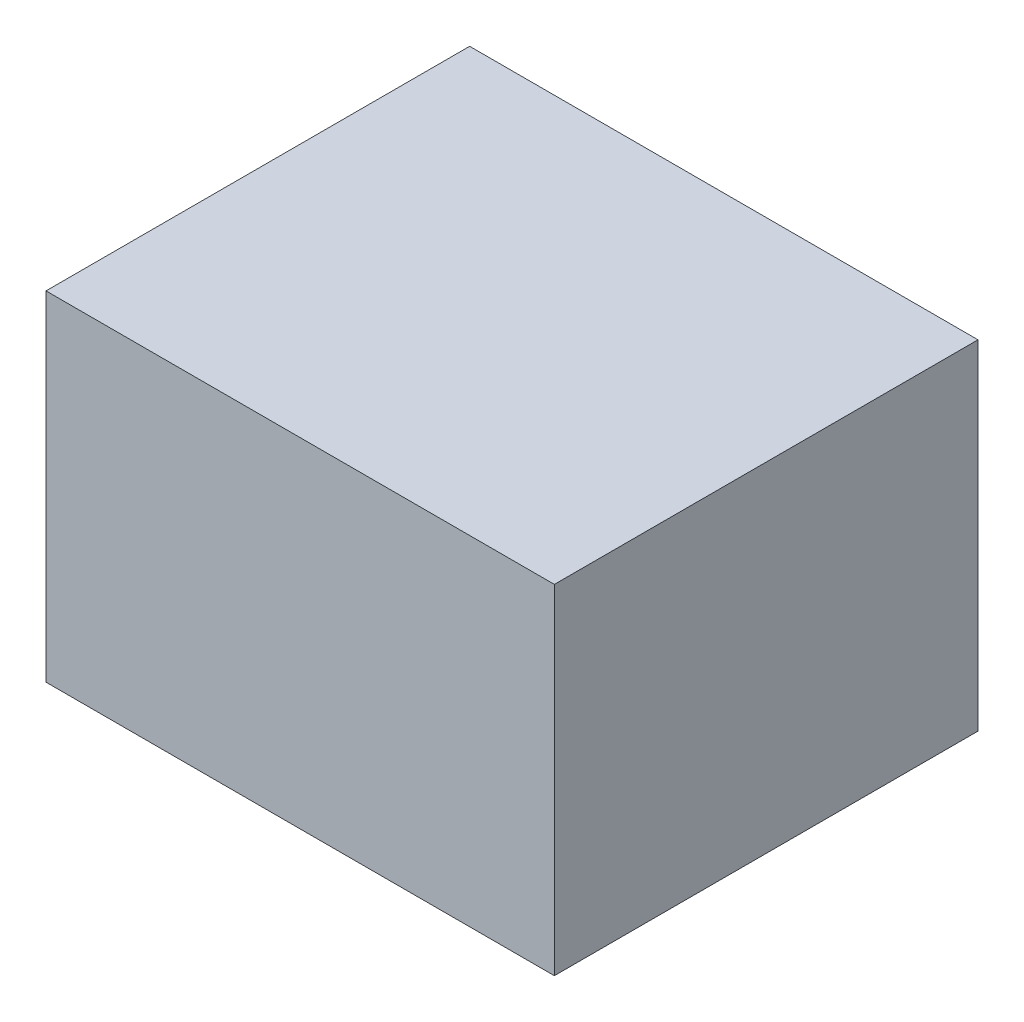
from build123d import *

# Parameters (mm, degrees)
ESQUISSE1_W        = 60
ESQUISSE1_H        = 40
BOSS_EXTRU_1_DEPTH = 25


with BuildPart() as part:
    # Esquisse1 → Boss.-Extru.1 (new, symmetric)
    with BuildSketch(Plane.XY):
        with Locations((30, 20)):
            Rectangle(ESQUISSE1_W, ESQUISSE1_H)
    extrude(amount=BOSS_EXTRU_1_DEPTH, both=True)


solid = part.part
